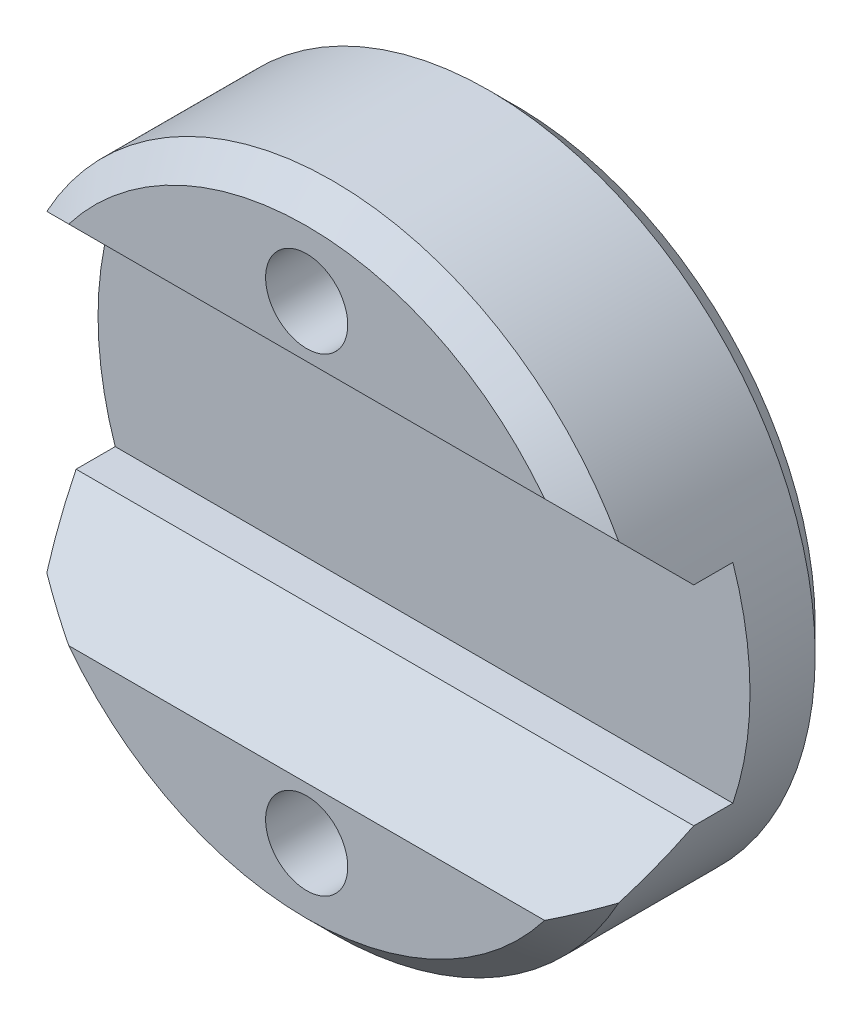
from build123d import *

# Parameters (mm, degrees)
ESQUISSE1_R             = 25
BASE_EXTRUSION_DEPTH    = 16
ESQUISSE6_R             = 3.15
ENL_V_MAT_EXTRU_6_DEPTH = 39.807215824
CHANFREIN1_SIZE         = 2
CHANFREIN2_SIZE         = 2
ESQUISSE21_W            = 9
ESQUISSE21_H            = 16
ENL_V_MAT_EXTRU_8_DEPTH = 50
CHANFREIN5_SIZE         = 6


with BuildPart() as part:
    # Esquisse1 → Base-Extrusion (new body)
    with BuildSketch(Plane.XY):
        Circle(ESQUISSE1_R)
    extrude(amount=BASE_EXTRUSION_DEPTH)

    # Esquisse6 → Enl_v. mat.-Extru.6 (cut, through all)
    with BuildSketch(Plane.XY.offset(16)):
        with Locations((0, 18)):
            Circle(ESQUISSE6_R)
        with Locations((0, -18)):
            Circle(ESQUISSE6_R)
    extrude(amount=-ENL_V_MAT_EXTRU_6_DEPTH, mode=Mode.SUBTRACT)

    # Chanfrein1
    chanfrein1_edges = [part.edges().sort_by_distance(p)[0] for p in [
        (-25, 0, 0),
    ]]
    chamfer(chanfrein1_edges, length=CHANFREIN1_SIZE)

    # Chanfrein2
    chanfrein2_edges = [part.edges().sort_by_distance(p)[0] for p in [
        (-25, 0, 16),
    ]]
    chamfer(chanfrein2_edges, length=CHANFREIN2_SIZE)

    # Esquisse21 → Enl_v. mat.-Extru.8 (cut, symmetric)
    with BuildSketch(Plane(origin=(0, 0, 0), x_dir=(0, 0, -1), z_dir=(1, 0, 0))):
        with Locations((-11.5, 0)):
            Rectangle(ESQUISSE21_W, ESQUISSE21_H)
    extrude(amount=ENL_V_MAT_EXTRU_8_DEPTH, both=True, mode=Mode.SUBTRACT)

    # Chanfrein5
    chanfrein5_edges = [part.edges().sort_by_distance(p)[0] for p in [
        (0, 8, 16),
        (0, -8, 16),
    ]]
    chamfer(chanfrein5_edges, length=CHANFREIN5_SIZE)


solid = part.part
